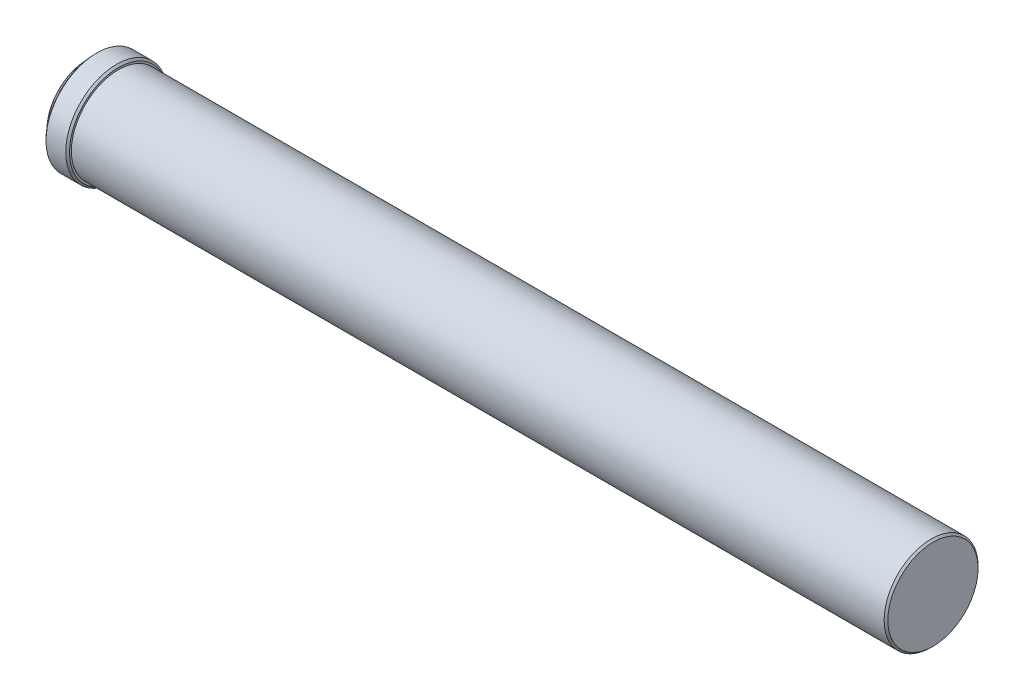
ISO-10303-21;
HEADER;
FILE_DESCRIPTION(('STEP AP214'),'2;1');
FILE_NAME('part.step','',(''),(''),'','','');
FILE_SCHEMA(('AUTOMOTIVE_DESIGN { 1 0 10303 214 1 1 1 1 }'));
ENDSEC;
DATA;
#1=APPLICATION_CONTEXT('core data for automotive mechanical design processes');
#2=APPLICATION_PROTOCOL_DEFINITION('international standard','automotive_design',2000,#1);
#3=PRODUCT_CONTEXT('',#1,'mechanical');
#4=PRODUCT('Part','Part','',(#3));
#5=PRODUCT_RELATED_PRODUCT_CATEGORY('part','',(#4));
#6=PRODUCT_DEFINITION_FORMATION('','',#4);
#7=PRODUCT_DEFINITION_CONTEXT('part definition',#1,'design');
#8=PRODUCT_DEFINITION('design','',#6,#7);
#9=PRODUCT_DEFINITION_SHAPE('','',#8);
#10=(LENGTH_UNIT() NAMED_UNIT(*) SI_UNIT(.MILLI.,.METRE.));
#11=(NAMED_UNIT(*) PLANE_ANGLE_UNIT() SI_UNIT($,.RADIAN.));
#12=(NAMED_UNIT(*) SI_UNIT($,.STERADIAN.) SOLID_ANGLE_UNIT());
#13=UNCERTAINTY_MEASURE_WITH_UNIT(LENGTH_MEASURE(1.E-05),#10,'distance_accuracy_value','');
#14=(GEOMETRIC_REPRESENTATION_CONTEXT(3) GLOBAL_UNCERTAINTY_ASSIGNED_CONTEXT((#13)) GLOBAL_UNIT_ASSIGNED_CONTEXT((#10,
#11,#12)) REPRESENTATION_CONTEXT('',''));
#15=CARTESIAN_POINT('',(0.,0.,0.));
#16=DIRECTION('',(0.,0.,1.));
#17=DIRECTION('',(1.,0.,0.));
#18=AXIS2_PLACEMENT_3D('',#15,#16,#17);
#19=CARTESIAN_POINT('',(0.,0.,0.));
#20=DIRECTION('',(-1.,0.,0.));
#21=DIRECTION('',(0.,0.,1.));
#22=AXIS2_PLACEMENT_3D('',#19,#20,#21);
#23=PLANE('',#22);
#24=CARTESIAN_POINT('',(0.,0.,0.));
#25=DIRECTION('',(-1.,0.,0.));
#26=DIRECTION('',(0.,0.,1.));
#27=AXIS2_PLACEMENT_3D('',#24,#25,#26);
#28=CIRCLE('',#27,48.);
#29=CARTESIAN_POINT('',(0.,0.,48.));
#30=VERTEX_POINT('',#29);
#31=EDGE_CURVE('E12',#30,#30,#28,.T.);
#32=ORIENTED_EDGE('',*,*,#31,.F.);
#33=EDGE_LOOP('',(#32));
#34=FACE_BOUND('',#33,.T.);
#35=ADVANCED_FACE('F42',(#34),#23,.F.);
#36=CARTESIAN_POINT('',(0.,0.,0.));
#37=DIRECTION('',(-1.,0.,0.));
#38=DIRECTION('',(0.,0.,1.));
#39=AXIS2_PLACEMENT_3D('',#36,#37,#38);
#40=CONICAL_SURFACE('',#39,48.,0.78539816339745);
#41=CARTESIAN_POINT('',(-2.,0.,0.));
#42=DIRECTION('',(-1.,0.,0.));
#43=DIRECTION('',(0.,0.,1.));
#44=AXIS2_PLACEMENT_3D('',#41,#42,#43);
#45=CIRCLE('',#44,50.);
#46=CARTESIAN_POINT('',(-2.,0.,50.));
#47=VERTEX_POINT('',#46);
#48=EDGE_CURVE('E48',#47,#47,#45,.T.);
#49=ORIENTED_EDGE('',*,*,#48,.F.);
#50=EDGE_LOOP('',(#49));
#51=FACE_BOUND('',#50,.T.);
#52=ORIENTED_EDGE('',*,*,#31,.T.);
#53=EDGE_LOOP('',(#52));
#54=FACE_BOUND('',#53,.T.);
#55=ADVANCED_FACE('F135',(#51,#54),#40,.T.);
#56=CARTESIAN_POINT('',(-900.,0.,0.));
#57=DIRECTION('',(-1.,0.,0.));
#58=DIRECTION('',(0.,0.,1.));
#59=AXIS2_PLACEMENT_3D('',#56,#57,#58);
#60=CYLINDRICAL_SURFACE('',#59,50.);
#61=CARTESIAN_POINT('',(-867.,0.,0.));
#62=DIRECTION('',(-1.,0.,0.));
#63=DIRECTION('',(0.,0.,1.));
#64=AXIS2_PLACEMENT_3D('',#61,#62,#63);
#65=CIRCLE('',#64,49.9999999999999);
#66=CARTESIAN_POINT('',(-867.,0.,49.9999999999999));
#67=VERTEX_POINT('',#66);
#68=EDGE_CURVE('E52',#67,#67,#65,.T.);
#69=ORIENTED_EDGE('',*,*,#68,.F.);
#70=EDGE_LOOP('',(#69));
#71=FACE_BOUND('',#70,.T.);
#72=ORIENTED_EDGE('',*,*,#48,.T.);
#73=EDGE_LOOP('',(#72));
#74=FACE_BOUND('',#73,.T.);
#75=ADVANCED_FACE('F130',(#71,#74),#60,.T.);
#76=CARTESIAN_POINT('',(-867.,52.,0.));
#77=DIRECTION('',(-1.,0.,0.));
#78=DIRECTION('',(0.,0.,1.));
#79=AXIS2_PLACEMENT_3D('',#76,#77,#78);
#80=PLANE('',#79);
#81=CARTESIAN_POINT('',(-867.,0.,0.));
#82=DIRECTION('',(-1.,0.,0.));
#83=DIRECTION('',(0.,0.,1.));
#84=AXIS2_PLACEMENT_3D('',#81,#82,#83);
#85=CIRCLE('',#84,52.);
#86=CARTESIAN_POINT('',(-867.,0.,52.));
#87=VERTEX_POINT('',#86);
#88=EDGE_CURVE('E56',#87,#87,#85,.T.);
#89=ORIENTED_EDGE('',*,*,#88,.F.);
#90=EDGE_LOOP('',(#89));
#91=FACE_BOUND('',#90,.T.);
#92=ORIENTED_EDGE('',*,*,#68,.T.);
#93=EDGE_LOOP('',(#92));
#94=FACE_BOUND('',#93,.T.);
#95=ADVANCED_FACE('F124',(#91,#94),#80,.F.);
#96=CARTESIAN_POINT('',(-867.,0.,0.));
#97=DIRECTION('',(-1.,0.,0.));
#98=DIRECTION('',(0.,0.,1.));
#99=AXIS2_PLACEMENT_3D('',#96,#97,#98);
#100=CONICAL_SURFACE('',#99,52.,0.785398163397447);
#101=CARTESIAN_POINT('',(-869.,0.,0.));
#102=DIRECTION('',(-1.,0.,0.));
#103=DIRECTION('',(0.,0.,1.));
#104=AXIS2_PLACEMENT_3D('',#101,#102,#103);
#105=CIRCLE('',#104,54.);
#106=CARTESIAN_POINT('',(-869.,0.,54.));
#107=VERTEX_POINT('',#106);
#108=EDGE_CURVE('E61',#107,#107,#105,.T.);
#109=ORIENTED_EDGE('',*,*,#108,.F.);
#110=EDGE_LOOP('',(#109));
#111=FACE_BOUND('',#110,.T.);
#112=ORIENTED_EDGE('',*,*,#88,.T.);
#113=EDGE_LOOP('',(#112));
#114=FACE_BOUND('',#113,.T.);
#115=ADVANCED_FACE('F118',(#111,#114),#100,.T.);
#116=CARTESIAN_POINT('',(-900.,0.,0.));
#117=DIRECTION('',(-1.,0.,0.));
#118=DIRECTION('',(0.,0.,1.));
#119=AXIS2_PLACEMENT_3D('',#116,#117,#118);
#120=CYLINDRICAL_SURFACE('',#119,54.);
#121=CARTESIAN_POINT('',(-890.,0.,0.));
#122=DIRECTION('',(-1.,0.,0.));
#123=DIRECTION('',(0.,0.,1.));
#124=AXIS2_PLACEMENT_3D('',#121,#122,#123);
#125=CIRCLE('',#124,54.);
#126=CARTESIAN_POINT('',(-890.,0.,54.));
#127=VERTEX_POINT('',#126);
#128=EDGE_CURVE('E64',#127,#127,#125,.T.);
#129=ORIENTED_EDGE('',*,*,#128,.F.);
#130=EDGE_LOOP('',(#129));
#131=FACE_BOUND('',#130,.T.);
#132=ORIENTED_EDGE('',*,*,#108,.T.);
#133=EDGE_LOOP('',(#132));
#134=FACE_BOUND('',#133,.T.);
#135=ADVANCED_FACE('F112',(#131,#134),#120,.T.);
#136=CARTESIAN_POINT('',(-890.,0.,0.));
#137=DIRECTION('',(1.,0.,0.));
#138=DIRECTION('',(0.,0.,-1.));
#139=AXIS2_PLACEMENT_3D('',#136,#137,#138);
#140=CONICAL_SURFACE('',#139,54.,0.785398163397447);
#141=CARTESIAN_POINT('',(-892.,0.,0.));
#142=DIRECTION('',(-1.,0.,0.));
#143=DIRECTION('',(0.,0.,1.));
#144=AXIS2_PLACEMENT_3D('',#141,#142,#143);
#145=CIRCLE('',#144,52.);
#146=CARTESIAN_POINT('',(-892.,0.,52.));
#147=VERTEX_POINT('',#146);
#148=EDGE_CURVE('E67',#147,#147,#145,.T.);
#149=ORIENTED_EDGE('',*,*,#148,.F.);
#150=EDGE_LOOP('',(#149));
#151=FACE_BOUND('',#150,.T.);
#152=ORIENTED_EDGE('',*,*,#128,.T.);
#153=EDGE_LOOP('',(#152));
#154=FACE_BOUND('',#153,.T.);
#155=ADVANCED_FACE('F106',(#151,#154),#140,.T.);
#156=CARTESIAN_POINT('',(-892.,52.,0.));
#157=DIRECTION('',(1.,0.,0.));
#158=DIRECTION('',(0.,0.,-1.));
#159=AXIS2_PLACEMENT_3D('',#156,#157,#158);
#160=PLANE('',#159);
#161=CARTESIAN_POINT('',(-892.,0.,0.));
#162=DIRECTION('',(-1.,0.,0.));
#163=DIRECTION('',(0.,0.,1.));
#164=AXIS2_PLACEMENT_3D('',#161,#162,#163);
#165=CIRCLE('',#164,46.);
#166=CARTESIAN_POINT('',(-892.,0.,46.));
#167=VERTEX_POINT('',#166);
#168=EDGE_CURVE('E70',#167,#167,#165,.T.);
#169=ORIENTED_EDGE('',*,*,#168,.F.);
#170=EDGE_LOOP('',(#169));
#171=FACE_BOUND('',#170,.T.);
#172=ORIENTED_EDGE('',*,*,#148,.T.);
#173=EDGE_LOOP('',(#172));
#174=FACE_BOUND('',#173,.T.);
#175=ADVANCED_FACE('F100',(#171,#174),#160,.F.);
#176=CARTESIAN_POINT('',(-892.,0.,0.));
#177=DIRECTION('',(1.,0.,0.));
#178=DIRECTION('',(0.,0.,-1.));
#179=AXIS2_PLACEMENT_3D('',#176,#177,#178);
#180=CONICAL_SURFACE('',#179,46.,0.785398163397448);
#181=CARTESIAN_POINT('',(-894.,0.,0.));
#182=DIRECTION('',(-1.,0.,0.));
#183=DIRECTION('',(0.,0.,1.));
#184=AXIS2_PLACEMENT_3D('',#181,#182,#183);
#185=CIRCLE('',#184,44.);
#186=CARTESIAN_POINT('',(-894.,0.,44.));
#187=VERTEX_POINT('',#186);
#188=EDGE_CURVE('E73',#187,#187,#185,.T.);
#189=ORIENTED_EDGE('',*,*,#188,.F.);
#190=EDGE_LOOP('',(#189));
#191=FACE_BOUND('',#190,.T.);
#192=ORIENTED_EDGE('',*,*,#168,.T.);
#193=EDGE_LOOP('',(#192));
#194=FACE_BOUND('',#193,.T.);
#195=ADVANCED_FACE('F94',(#191,#194),#180,.T.);
#196=CARTESIAN_POINT('',(-900.,0.,0.));
#197=DIRECTION('',(-1.,0.,0.));
#198=DIRECTION('',(0.,0.,1.));
#199=AXIS2_PLACEMENT_3D('',#196,#197,#198);
#200=CYLINDRICAL_SURFACE('',#199,44.);
#201=CARTESIAN_POINT('',(-899.,0.,0.));
#202=DIRECTION('',(-1.,0.,0.));
#203=DIRECTION('',(0.,0.,1.));
#204=AXIS2_PLACEMENT_3D('',#201,#202,#203);
#205=CIRCLE('',#204,44.);
#206=CARTESIAN_POINT('',(-899.,0.,44.));
#207=VERTEX_POINT('',#206);
#208=EDGE_CURVE('E76',#207,#207,#205,.T.);
#209=ORIENTED_EDGE('',*,*,#208,.F.);
#210=EDGE_LOOP('',(#209));
#211=FACE_BOUND('',#210,.T.);
#212=ORIENTED_EDGE('',*,*,#188,.T.);
#213=EDGE_LOOP('',(#212));
#214=FACE_BOUND('',#213,.T.);
#215=ADVANCED_FACE('F88',(#211,#214),#200,.T.);
#216=CARTESIAN_POINT('',(-899.,0.,0.));
#217=DIRECTION('',(1.,0.,0.));
#218=DIRECTION('',(0.,0.,-1.));
#219=AXIS2_PLACEMENT_3D('',#216,#217,#218);
#220=CONICAL_SURFACE('',#219,44.,0.785398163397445);
#221=CARTESIAN_POINT('',(-900.,0.,0.));
#222=DIRECTION('',(-1.,0.,0.));
#223=DIRECTION('',(0.,0.,1.));
#224=AXIS2_PLACEMENT_3D('',#221,#222,#223);
#225=CIRCLE('',#224,43.);
#226=CARTESIAN_POINT('',(-900.,0.,43.));
#227=VERTEX_POINT('',#226);
#228=EDGE_CURVE('E79',#227,#227,#225,.T.);
#229=ORIENTED_EDGE('',*,*,#228,.F.);
#230=EDGE_LOOP('',(#229));
#231=FACE_BOUND('',#230,.T.);
#232=ORIENTED_EDGE('',*,*,#208,.T.);
#233=EDGE_LOOP('',(#232));
#234=FACE_BOUND('',#233,.T.);
#235=ADVANCED_FACE('F85',(#231,#234),#220,.T.);
#236=CARTESIAN_POINT('',(-900.,43.,0.));
#237=DIRECTION('',(1.,0.,0.));
#238=DIRECTION('',(0.,0.,-1.));
#239=AXIS2_PLACEMENT_3D('',#236,#237,#238);
#240=PLANE('',#239);
#241=ORIENTED_EDGE('',*,*,#228,.T.);
#242=EDGE_LOOP('',(#241));
#243=FACE_BOUND('',#242,.T.);
#244=ADVANCED_FACE('F83',(#243),#240,.F.);
#245=CLOSED_SHELL('',(#35,#55,#75,#95,#115,#135,#155,#175,#195,#215,#235,#244));
#246=MANIFOLD_SOLID_BREP('B2',#245);
#247=ADVANCED_BREP_SHAPE_REPRESENTATION('',(#18,#246),#14);
#248=SHAPE_DEFINITION_REPRESENTATION(#9,#247);
ENDSEC;
END-ISO-10303-21;
